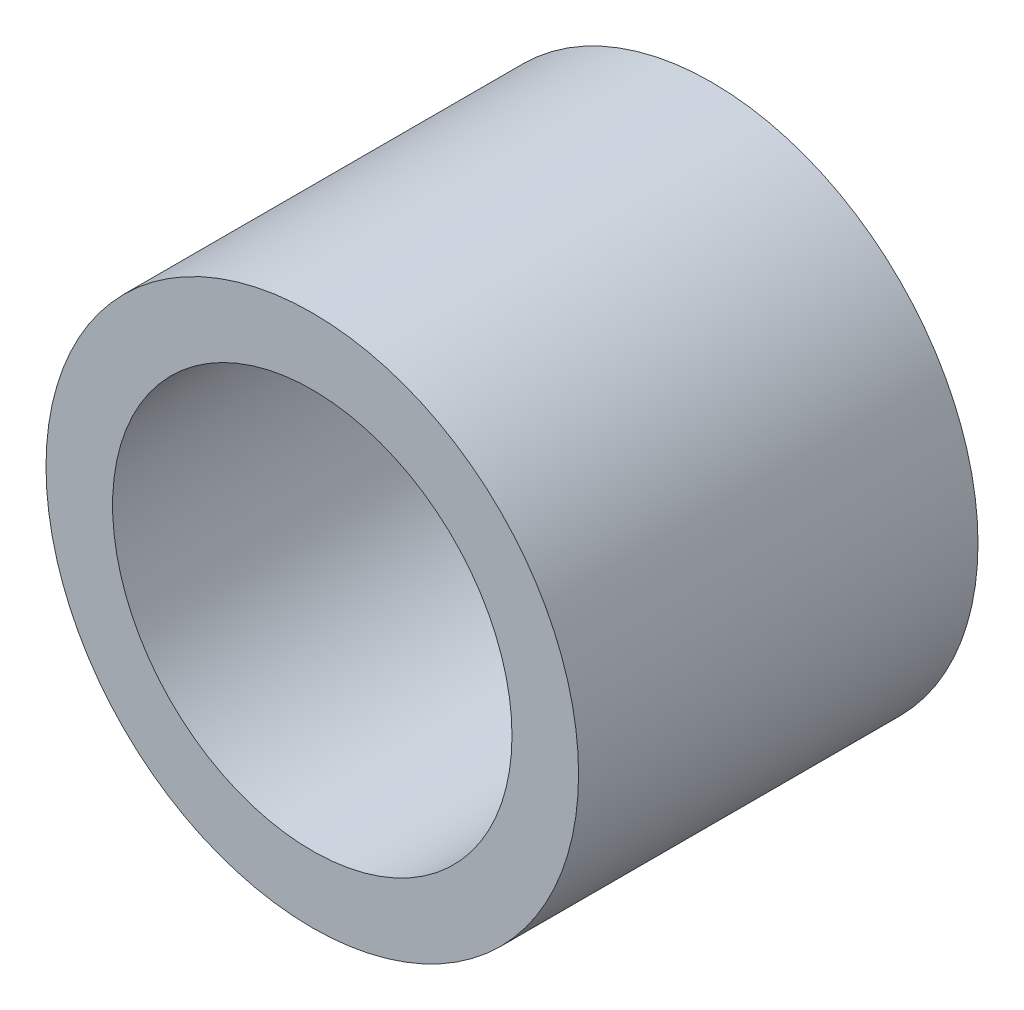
from build123d import *

# Parameters (mm, degrees)
SKETCH_1_R      = 20
SKETCH_1_R_2    = 15
EXTRUDE_1_DEPTH = 30


with BuildPart() as part:
    # Sketch 1 → Extrude 1 (new body)
    with BuildSketch(Plane.XY):
        Circle(SKETCH_1_R)
        Circle(SKETCH_1_R_2, mode=Mode.SUBTRACT)
    extrude(amount=EXTRUDE_1_DEPTH)


solid = part.part
